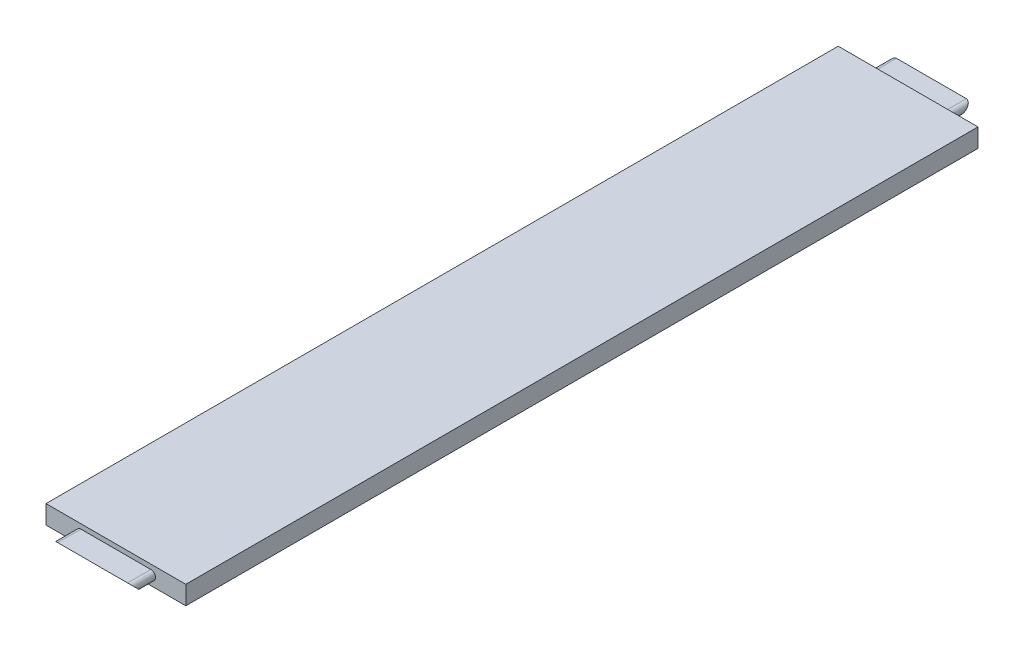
from build123d import *

# Parameters (mm, degrees)
CROQUIS1_W                      = 170
CROQUIS1_H                      = 25
EXTRUIR1_DEPTH                  = 460
CEPILLADO_REGRUESADO_DEPTH      = 468.954324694
CEPILLADO_REGRUESADO_DEPTH_BACK = 468.954324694
CROQUIS2_W                      = 150
CROQUIS2_H                      = 20
CROQUIS3_W                      = 150
CROQUIS3_H                      = 10
LARGO_CORTE_DEPTH               = 467.502947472
CROQUIS4_W                      = 150
CROQUIS4_H                      = 20
CORTAR_EXTRUIR3_DEPTH           = 25
CORTAR_EXTRUIR4_DEPTH           = 457.316775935


with BuildPart() as part:
    # Croquis1 → Extruir1 (new, symmetric)
    with BuildSketch(Plane.XY):
        Rectangle(CROQUIS1_W, CROQUIS1_H)
    extrude(amount=EXTRUIR1_DEPTH, both=True)

    # Croquis2 → Cepillado -Regruesado (cut, two sides: drawn at the far end of the back side and taken through both)
    with BuildSketch(Plane.XY.offset(-CEPILLADO_REGRUESADO_DEPTH_BACK)):
        Polygon((-85, 12.5), (85, 12.5), (85, 10), (85, -10), (85, -12.5), (-85, -12.5), (-85, -10), (-85, 10), align=None)
        Rectangle(CROQUIS2_W, CROQUIS2_H, mode=Mode.SUBTRACT)
    extrude(amount=CEPILLADO_REGRUESADO_DEPTH + CEPILLADO_REGRUESADO_DEPTH_BACK, mode=Mode.SUBTRACT)

    # Croquis3 → Largo - Corte (cut, through all)
    with BuildSketch(Plane(origin=(0, 10, 0), x_dir=(1, 0, 0), z_dir=(0, 1, 0))):
        with Locations((0, 455)):
            Rectangle(CROQUIS3_W, CROQUIS3_H)
        with Locations((0, -455)):
            Rectangle(CROQUIS3_W, CROQUIS3_H)
    extrude(amount=-LARGO_CORTE_DEPTH, mode=Mode.SUBTRACT)

    # Croquis4 → Cortar-Extruir3 (cut)
    with BuildSketch(Plane.XY.offset(450)):
        Rectangle(CROQUIS4_W, CROQUIS4_H)
        with BuildLine():
            Line((-37.5, 5), (37.5, 5))
            ThreePointArc((37.5, 5), (42.5, 0), (37.5, -5))
            Line((37.5, -5), (-37.5, -5))
            ThreePointArc((-37.5, -5), (-42.5, 0), (-37.5, 5))
        make_face(mode=Mode.SUBTRACT)
    cortar_extruir3 = extrude(amount=-CORTAR_EXTRUIR3_DEPTH, mode=Mode.SUBTRACT)

    # Croquis5 → Cortar-Extruir4 (cut, symmetric)
    with BuildSketch(Plane(origin=(0, 0, 0), x_dir=(0, 0, -1), z_dir=(1, 0, 0))):
        Polygon((-450, 5), (-440, -5), (-450, -5), align=None)
    cortar_extruir4 = extrude(amount=CORTAR_EXTRUIR4_DEPTH, both=True, mode=Mode.SUBTRACT)

    # Simetr_a1: Cortar-Extruir3, Cortar-Extruir4 across plane
    add(cortar_extruir3.mirror(Plane.XY), mode=Mode.SUBTRACT)
    add(cortar_extruir4.mirror(Plane.XY), mode=Mode.SUBTRACT)


solid = part.part
